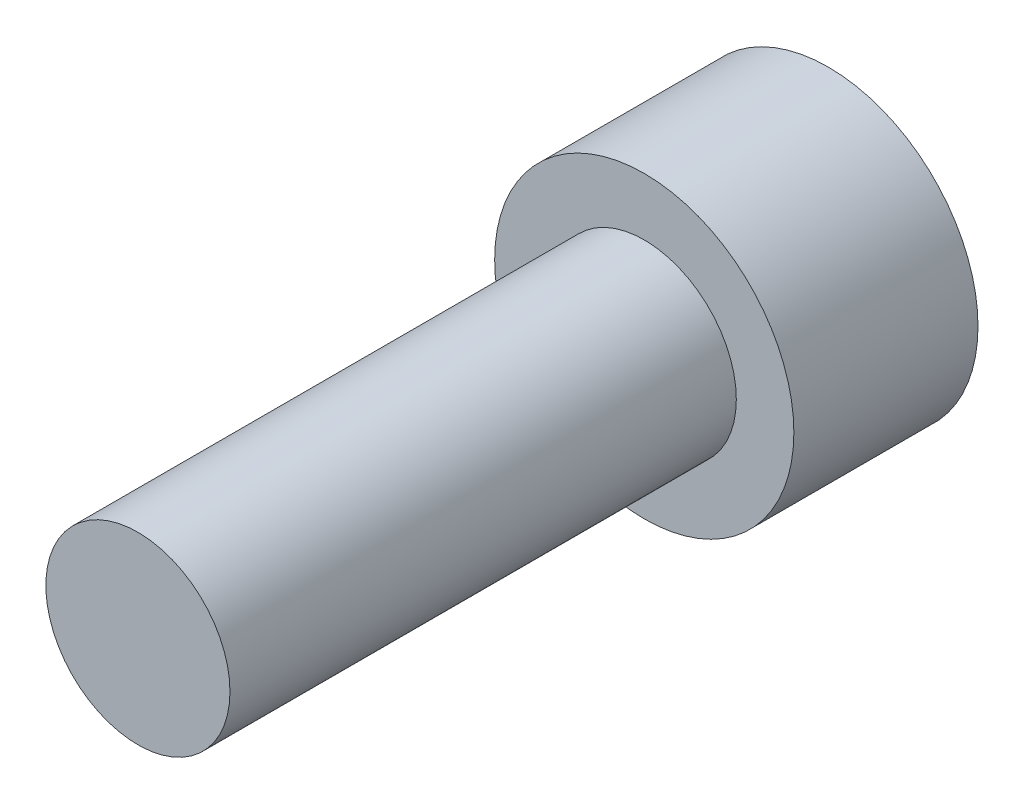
ISO-10303-21;
HEADER;
FILE_DESCRIPTION(('STEP AP214'),'2;1');
FILE_NAME('part.step','',(''),(''),'','','');
FILE_SCHEMA(('AUTOMOTIVE_DESIGN { 1 0 10303 214 1 1 1 1 }'));
ENDSEC;
DATA;
#1=APPLICATION_CONTEXT('core data for automotive mechanical design processes');
#2=APPLICATION_PROTOCOL_DEFINITION('international standard','automotive_design',2000,#1);
#3=PRODUCT_CONTEXT('',#1,'mechanical');
#4=PRODUCT('Part','Part','',(#3));
#5=PRODUCT_RELATED_PRODUCT_CATEGORY('part','',(#4));
#6=PRODUCT_DEFINITION_FORMATION('','',#4);
#7=PRODUCT_DEFINITION_CONTEXT('part definition',#1,'design');
#8=PRODUCT_DEFINITION('design','',#6,#7);
#9=PRODUCT_DEFINITION_SHAPE('','',#8);
#10=(LENGTH_UNIT() NAMED_UNIT(*) SI_UNIT(.MILLI.,.METRE.));
#11=(NAMED_UNIT(*) PLANE_ANGLE_UNIT() SI_UNIT($,.RADIAN.));
#12=(NAMED_UNIT(*) SI_UNIT($,.STERADIAN.) SOLID_ANGLE_UNIT());
#13=UNCERTAINTY_MEASURE_WITH_UNIT(LENGTH_MEASURE(1.E-05),#10,'distance_accuracy_value','');
#14=(GEOMETRIC_REPRESENTATION_CONTEXT(3) GLOBAL_UNCERTAINTY_ASSIGNED_CONTEXT((#13)) GLOBAL_UNIT_ASSIGNED_CONTEXT((#10,
#11,#12)) REPRESENTATION_CONTEXT('',''));
#15=CARTESIAN_POINT('',(0.,0.,0.));
#16=DIRECTION('',(0.,0.,1.));
#17=DIRECTION('',(1.,0.,0.));
#18=AXIS2_PLACEMENT_3D('',#15,#16,#17);
#19=CARTESIAN_POINT('',(0.,0.,22.));
#20=DIRECTION('',(0.,0.,1.));
#21=DIRECTION('',(1.,0.,0.));
#22=AXIS2_PLACEMENT_3D('',#19,#20,#21);
#23=PLANE('',#22);
#24=CARTESIAN_POINT('',(0.,0.,22.));
#25=DIRECTION('',(0.,0.,1.));
#26=DIRECTION('',(1.,0.,0.));
#27=AXIS2_PLACEMENT_3D('',#24,#25,#26);
#28=CIRCLE('',#27,4.);
#29=CARTESIAN_POINT('',(4.,0.,22.));
#30=VERTEX_POINT('',#29);
#31=EDGE_CURVE('E11',#30,#30,#28,.T.);
#32=ORIENTED_EDGE('',*,*,#31,.T.);
#33=EDGE_LOOP('',(#32));
#34=FACE_BOUND('',#33,.T.);
#35=ADVANCED_FACE('F32',(#34),#23,.T.);
#36=CARTESIAN_POINT('',(0.,0.,22.));
#37=DIRECTION('',(0.,0.,1.));
#38=DIRECTION('',(1.,0.,0.));
#39=AXIS2_PLACEMENT_3D('',#36,#37,#38);
#40=CYLINDRICAL_SURFACE('',#39,4.);
#41=CARTESIAN_POINT('',(0.,0.,0.));
#42=DIRECTION('',(0.,0.,1.));
#43=DIRECTION('',(1.,0.,0.));
#44=AXIS2_PLACEMENT_3D('',#41,#42,#43);
#45=CIRCLE('',#44,4.);
#46=CARTESIAN_POINT('',(4.,0.,0.));
#47=VERTEX_POINT('',#46);
#48=EDGE_CURVE('E39',#47,#47,#45,.T.);
#49=ORIENTED_EDGE('',*,*,#48,.T.);
#50=EDGE_LOOP('',(#49));
#51=FACE_BOUND('',#50,.T.);
#52=ORIENTED_EDGE('',*,*,#31,.F.);
#53=EDGE_LOOP('',(#52));
#54=FACE_BOUND('',#53,.T.);
#55=ADVANCED_FACE('F146',(#51,#54),#40,.T.);
#56=CARTESIAN_POINT('',(0.,-4.,0.));
#57=DIRECTION('',(0.,0.,1.));
#58=DIRECTION('',(1.,0.,0.));
#59=AXIS2_PLACEMENT_3D('',#56,#57,#58);
#60=PLANE('',#59);
#61=CARTESIAN_POINT('',(0.,0.,0.));
#62=DIRECTION('',(0.,0.,1.));
#63=DIRECTION('',(1.,0.,0.));
#64=AXIS2_PLACEMENT_3D('',#61,#62,#63);
#65=CIRCLE('',#64,6.5);
#66=CARTESIAN_POINT('',(6.5,0.,0.));
#67=VERTEX_POINT('',#66);
#68=EDGE_CURVE('E141',#67,#67,#65,.T.);
#69=ORIENTED_EDGE('',*,*,#68,.T.);
#70=EDGE_LOOP('',(#69));
#71=FACE_BOUND('',#70,.T.);
#72=ORIENTED_EDGE('',*,*,#48,.F.);
#73=EDGE_LOOP('',(#72));
#74=FACE_BOUND('',#73,.T.);
#75=ADVANCED_FACE('F149',(#71,#74),#60,.T.);
#76=CARTESIAN_POINT('',(0.,0.,22.));
#77=DIRECTION('',(0.,0.,1.));
#78=DIRECTION('',(1.,0.,0.));
#79=AXIS2_PLACEMENT_3D('',#76,#77,#78);
#80=CYLINDRICAL_SURFACE('',#79,6.5);
#81=CARTESIAN_POINT('',(0.,0.,-8.));
#82=DIRECTION('',(0.,0.,1.));
#83=DIRECTION('',(1.,0.,0.));
#84=AXIS2_PLACEMENT_3D('',#81,#82,#83);
#85=CIRCLE('',#84,6.5);
#86=CARTESIAN_POINT('',(6.5,0.,-8.));
#87=VERTEX_POINT('',#86);
#88=EDGE_CURVE('E133',#87,#87,#85,.T.);
#89=ORIENTED_EDGE('',*,*,#88,.T.);
#90=EDGE_LOOP('',(#89));
#91=FACE_BOUND('',#90,.T.);
#92=ORIENTED_EDGE('',*,*,#68,.F.);
#93=EDGE_LOOP('',(#92));
#94=FACE_BOUND('',#93,.T.);
#95=ADVANCED_FACE('F151',(#91,#94),#80,.T.);
#96=CARTESIAN_POINT('',(0.,-6.5,-8.));
#97=DIRECTION('',(0.,0.,-1.));
#98=DIRECTION('',(-1.,0.,0.));
#99=AXIS2_PLACEMENT_3D('',#96,#97,#98);
#100=PLANE('',#99);
#101=DIRECTION('',(0.866025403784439,-0.5,0.));
#102=VECTOR('',#101,1.);
#103=CARTESIAN_POINT('',(0.,3.46410161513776,-8.));
#104=LINE('',#103,#102);
#105=CARTESIAN_POINT('',(0.,3.46410161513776,-8.));
#106=VERTEX_POINT('',#105);
#107=CARTESIAN_POINT('',(3.,1.73205080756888,-8.));
#108=VERTEX_POINT('',#107);
#109=EDGE_CURVE('E46',#106,#108,#104,.T.);
#110=ORIENTED_EDGE('',*,*,#109,.F.);
#111=DIRECTION('',(0.866025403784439,0.5,0.));
#112=VECTOR('',#111,1.);
#113=CARTESIAN_POINT('',(-3.,1.73205080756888,-8.));
#114=LINE('',#113,#112);
#115=CARTESIAN_POINT('',(-3.,1.73205080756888,-8.));
#116=VERTEX_POINT('',#115);
#117=EDGE_CURVE('E129',#116,#106,#114,.T.);
#118=ORIENTED_EDGE('',*,*,#117,.F.);
#119=DIRECTION('',(0.,1.,0.));
#120=VECTOR('',#119,1.);
#121=CARTESIAN_POINT('',(-3.,-1.73205080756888,-8.));
#122=LINE('',#121,#120);
#123=CARTESIAN_POINT('',(-3.,-1.73205080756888,-8.));
#124=VERTEX_POINT('',#123);
#125=EDGE_CURVE('E127',#124,#116,#122,.T.);
#126=ORIENTED_EDGE('',*,*,#125,.F.);
#127=DIRECTION('',(-0.866025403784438,0.5,0.));
#128=VECTOR('',#127,1.);
#129=CARTESIAN_POINT('',(0.,-3.46410161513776,-8.));
#130=LINE('',#129,#128);
#131=CARTESIAN_POINT('',(0.,-3.46410161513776,-8.));
#132=VERTEX_POINT('',#131);
#133=EDGE_CURVE('E94',#132,#124,#130,.T.);
#134=ORIENTED_EDGE('',*,*,#133,.F.);
#135=DIRECTION('',(-0.866025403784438,-0.5,0.));
#136=VECTOR('',#135,1.);
#137=CARTESIAN_POINT('',(3.,-1.73205080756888,-8.));
#138=LINE('',#137,#136);
#139=CARTESIAN_POINT('',(3.,-1.73205080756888,-8.));
#140=VERTEX_POINT('',#139);
#141=EDGE_CURVE('E123',#140,#132,#138,.T.);
#142=ORIENTED_EDGE('',*,*,#141,.F.);
#143=DIRECTION('',(0.,-1.,0.));
#144=VECTOR('',#143,1.);
#145=CARTESIAN_POINT('',(3.,1.73205080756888,-8.));
#146=LINE('',#145,#144);
#147=EDGE_CURVE('E120',#108,#140,#146,.T.);
#148=ORIENTED_EDGE('',*,*,#147,.F.);
#149=EDGE_LOOP('',(#110,#118,#126,#134,#142,#148));
#150=FACE_BOUND('',#149,.T.);
#151=ORIENTED_EDGE('',*,*,#88,.F.);
#152=EDGE_LOOP('',(#151));
#153=FACE_BOUND('',#152,.T.);
#154=ADVANCED_FACE('F158',(#150,#153),#100,.T.);
#155=CARTESIAN_POINT('',(0.,3.46410161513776,-2.));
#156=DIRECTION('',(0.5,0.866025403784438,0.));
#157=DIRECTION('',(-0.866025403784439,0.5,0.));
#158=AXIS2_PLACEMENT_3D('',#155,#156,#157);
#159=PLANE('',#158);
#160=ORIENTED_EDGE('',*,*,#109,.T.);
#161=DIRECTION('',(0.,0.,-1.));
#162=VECTOR('',#161,1.);
#163=CARTESIAN_POINT('',(3.,1.73205080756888,-2.));
#164=LINE('',#163,#162);
#165=CARTESIAN_POINT('',(3.,1.73205080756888,-2.));
#166=VERTEX_POINT('',#165);
#167=EDGE_CURVE('E76',#166,#108,#164,.T.);
#168=ORIENTED_EDGE('',*,*,#167,.F.);
#169=DIRECTION('',(0.866025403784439,-0.5,0.));
#170=VECTOR('',#169,1.);
#171=CARTESIAN_POINT('',(0.,3.46410161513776,-2.));
#172=LINE('',#171,#170);
#173=CARTESIAN_POINT('',(0.,3.46410161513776,-2.));
#174=VERTEX_POINT('',#173);
#175=EDGE_CURVE('E131',#174,#166,#172,.T.);
#176=ORIENTED_EDGE('',*,*,#175,.F.);
#177=DIRECTION('',(0.,0.,-1.));
#178=VECTOR('',#177,1.);
#179=CARTESIAN_POINT('',(0.,3.46410161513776,-2.));
#180=LINE('',#179,#178);
#181=EDGE_CURVE('E54',#174,#106,#180,.T.);
#182=ORIENTED_EDGE('',*,*,#181,.T.);
#183=EDGE_LOOP('',(#160,#168,#176,#182));
#184=FACE_BOUND('',#183,.T.);
#185=ADVANCED_FACE('F189',(#184),#159,.F.);
#186=CARTESIAN_POINT('',(-3.,1.73205080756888,-2.));
#187=DIRECTION('',(-0.5,0.866025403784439,0.));
#188=DIRECTION('',(-0.866025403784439,-0.5,0.));
#189=AXIS2_PLACEMENT_3D('',#186,#187,#188);
#190=PLANE('',#189);
#191=ORIENTED_EDGE('',*,*,#117,.T.);
#192=ORIENTED_EDGE('',*,*,#181,.F.);
#193=DIRECTION('',(0.866025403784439,0.5,0.));
#194=VECTOR('',#193,1.);
#195=CARTESIAN_POINT('',(-3.,1.73205080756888,-2.));
#196=LINE('',#195,#194);
#197=CARTESIAN_POINT('',(-3.,1.73205080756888,-2.));
#198=VERTEX_POINT('',#197);
#199=EDGE_CURVE('E106',#198,#174,#196,.T.);
#200=ORIENTED_EDGE('',*,*,#199,.F.);
#201=DIRECTION('',(0.,0.,-1.));
#202=VECTOR('',#201,1.);
#203=CARTESIAN_POINT('',(-3.,1.73205080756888,-2.));
#204=LINE('',#203,#202);
#205=EDGE_CURVE('E98',#198,#116,#204,.T.);
#206=ORIENTED_EDGE('',*,*,#205,.T.);
#207=EDGE_LOOP('',(#191,#192,#200,#206));
#208=FACE_BOUND('',#207,.T.);
#209=ADVANCED_FACE('F199',(#208),#190,.F.);
#210=CARTESIAN_POINT('',(-3.,-1.73205080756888,-2.));
#211=DIRECTION('',(-1.,0.,0.));
#212=DIRECTION('',(0.,-1.,0.));
#213=AXIS2_PLACEMENT_3D('',#210,#211,#212);
#214=PLANE('',#213);
#215=ORIENTED_EDGE('',*,*,#125,.T.);
#216=ORIENTED_EDGE('',*,*,#205,.F.);
#217=DIRECTION('',(0.,1.,0.));
#218=VECTOR('',#217,1.);
#219=CARTESIAN_POINT('',(-3.,-1.73205080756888,-2.));
#220=LINE('',#219,#218);
#221=CARTESIAN_POINT('',(-3.,-1.73205080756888,-2.));
#222=VERTEX_POINT('',#221);
#223=EDGE_CURVE('E102',#222,#198,#220,.T.);
#224=ORIENTED_EDGE('',*,*,#223,.F.);
#225=DIRECTION('',(0.,0.,-1.));
#226=VECTOR('',#225,1.);
#227=CARTESIAN_POINT('',(-3.,-1.73205080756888,-2.));
#228=LINE('',#227,#226);
#229=EDGE_CURVE('E87',#222,#124,#228,.T.);
#230=ORIENTED_EDGE('',*,*,#229,.T.);
#231=EDGE_LOOP('',(#215,#216,#224,#230));
#232=FACE_BOUND('',#231,.T.);
#233=ADVANCED_FACE('F103',(#232),#214,.F.);
#234=CARTESIAN_POINT('',(0.,-3.46410161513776,-2.));
#235=DIRECTION('',(-0.5,-0.866025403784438,0.));
#236=DIRECTION('',(0.866025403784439,-0.5,0.));
#237=AXIS2_PLACEMENT_3D('',#234,#235,#236);
#238=PLANE('',#237);
#239=ORIENTED_EDGE('',*,*,#133,.T.);
#240=ORIENTED_EDGE('',*,*,#229,.F.);
#241=DIRECTION('',(-0.866025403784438,0.5,0.));
#242=VECTOR('',#241,1.);
#243=CARTESIAN_POINT('',(0.,-3.46410161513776,-2.));
#244=LINE('',#243,#242);
#245=CARTESIAN_POINT('',(0.,-3.46410161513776,-2.));
#246=VERTEX_POINT('',#245);
#247=EDGE_CURVE('E91',#246,#222,#244,.T.);
#248=ORIENTED_EDGE('',*,*,#247,.F.);
#249=DIRECTION('',(0.,0.,-1.));
#250=VECTOR('',#249,1.);
#251=CARTESIAN_POINT('',(0.,-3.46410161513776,-2.));
#252=LINE('',#251,#250);
#253=EDGE_CURVE('E99',#246,#132,#252,.T.);
#254=ORIENTED_EDGE('',*,*,#253,.T.);
#255=EDGE_LOOP('',(#239,#240,#248,#254));
#256=FACE_BOUND('',#255,.T.);
#257=ADVANCED_FACE('F89',(#256),#238,.F.);
#258=CARTESIAN_POINT('',(3.,-1.73205080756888,-2.));
#259=DIRECTION('',(0.5,-0.866025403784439,0.));
#260=DIRECTION('',(0.866025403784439,0.5,0.));
#261=AXIS2_PLACEMENT_3D('',#258,#259,#260);
#262=PLANE('',#261);
#263=ORIENTED_EDGE('',*,*,#141,.T.);
#264=ORIENTED_EDGE('',*,*,#253,.F.);
#265=DIRECTION('',(-0.866025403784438,-0.5,0.));
#266=VECTOR('',#265,1.);
#267=CARTESIAN_POINT('',(3.,-1.73205080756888,-2.));
#268=LINE('',#267,#266);
#269=CARTESIAN_POINT('',(3.,-1.73205080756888,-2.));
#270=VERTEX_POINT('',#269);
#271=EDGE_CURVE('E112',#270,#246,#268,.T.);
#272=ORIENTED_EDGE('',*,*,#271,.F.);
#273=DIRECTION('',(0.,0.,-1.));
#274=VECTOR('',#273,1.);
#275=CARTESIAN_POINT('',(3.,-1.73205080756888,-2.));
#276=LINE('',#275,#274);
#277=EDGE_CURVE('E136',#270,#140,#276,.T.);
#278=ORIENTED_EDGE('',*,*,#277,.T.);
#279=EDGE_LOOP('',(#263,#264,#272,#278));
#280=FACE_BOUND('',#279,.T.);
#281=ADVANCED_FACE('F224',(#280),#262,.F.);
#282=CARTESIAN_POINT('',(3.,1.73205080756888,-2.));
#283=DIRECTION('',(1.,0.,0.));
#284=DIRECTION('',(0.,0.,-1.));
#285=AXIS2_PLACEMENT_3D('',#282,#283,#284);
#286=PLANE('',#285);
#287=ORIENTED_EDGE('',*,*,#147,.T.);
#288=ORIENTED_EDGE('',*,*,#277,.F.);
#289=DIRECTION('',(0.,-1.,0.));
#290=VECTOR('',#289,1.);
#291=CARTESIAN_POINT('',(3.,1.73205080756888,-2.));
#292=LINE('',#291,#290);
#293=EDGE_CURVE('E114',#166,#270,#292,.T.);
#294=ORIENTED_EDGE('',*,*,#293,.F.);
#295=ORIENTED_EDGE('',*,*,#167,.T.);
#296=EDGE_LOOP('',(#287,#288,#294,#295));
#297=FACE_BOUND('',#296,.T.);
#298=ADVANCED_FACE('F233',(#297),#286,.F.);
#299=CARTESIAN_POINT('',(6.,0.,-2.));
#300=DIRECTION('',(0.,0.,-1.));
#301=DIRECTION('',(-1.,0.,0.));
#302=AXIS2_PLACEMENT_3D('',#299,#300,#301);
#303=PLANE('',#302);
#304=ORIENTED_EDGE('',*,*,#175,.T.);
#305=ORIENTED_EDGE('',*,*,#293,.T.);
#306=ORIENTED_EDGE('',*,*,#271,.T.);
#307=ORIENTED_EDGE('',*,*,#247,.T.);
#308=ORIENTED_EDGE('',*,*,#223,.T.);
#309=ORIENTED_EDGE('',*,*,#199,.T.);
#310=EDGE_LOOP('',(#304,#305,#306,#307,#308,#309));
#311=FACE_BOUND('',#310,.T.);
#312=ADVANCED_FACE('F109',(#311),#303,.T.);
#313=CLOSED_SHELL('',(#35,#55,#75,#95,#154,#185,#209,#233,#257,#281,#298,#312));
#314=MANIFOLD_SOLID_BREP('B2',#313);
#315=ADVANCED_BREP_SHAPE_REPRESENTATION('',(#18,#314),#14);
#316=SHAPE_DEFINITION_REPRESENTATION(#9,#315);
ENDSEC;
END-ISO-10303-21;
